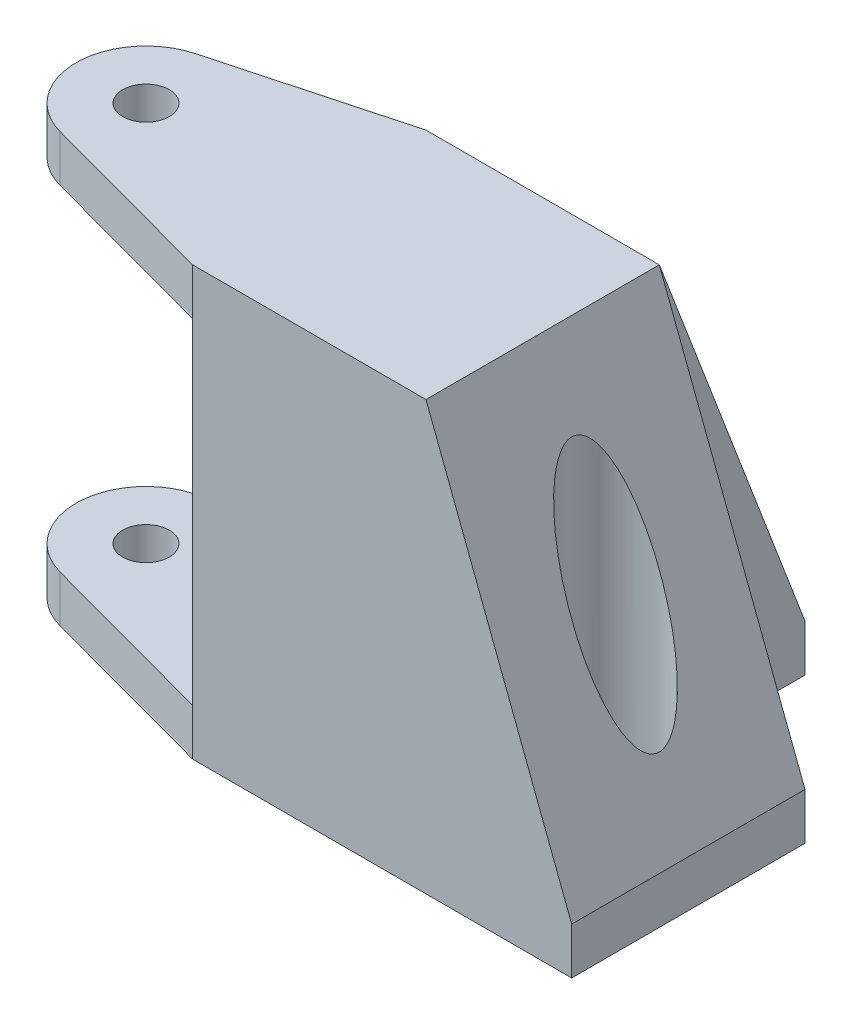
from build123d import *

# Parameters (mm, degrees)
BOSS_EXTRUDE1_DEPTH = 40
BOSS_EXTRUDE2_DEPTH = 73.391828
SKETCH4_W           = 40
SKETCH4_H           = 57.391828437
CUT_EXTRUDE1_DEPTH  = 73
BOSS_EXTRUDE3_DEPTH = 40
SKETCH6_R           = 4
CUT_EXTRUDE2_DEPTH  = 116.699440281
SKETCH8_R           = 7.5
CUT_EXTRUDE3_DEPTH  = 113.594148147


with BuildPart() as part:
    # Sketch2 → Boss-Extrude1 (new body)
    with BuildSketch(Plane.XY):
        Polygon((0, 0), (-40, 0), (-40, 73.391828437), (0, 73.391828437), (24.978165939, 8), (24.978165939, 0), align=None)
    extrude(amount=BOSS_EXTRUDE1_DEPTH)

    # Sketch3 → Boss-Extrude2 (add)
    with BuildSketch(Plane(origin=(0, 73.391828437, 0), x_dir=(1, 0, 0), z_dir=(0, 1, 0))):
        with BuildLine():
            Line((-40, -40), (-71.131560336, -31.584184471))
            ThreePointArc((-71.131560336, -31.584184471), (-80, -20), (-71.131560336, -8.415815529))
            Line((-71.131560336, -8.415815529), (-40, 0))
            Line((-40, 0), (-40, -40))
        make_face()
    extrude(amount=-BOSS_EXTRUDE2_DEPTH)

    # Sketch4 → Cut-Extrude1 (cut)
    with BuildSketch(Plane.XY):
        with Locations((-60, 36.695914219)):
            Rectangle(SKETCH4_W, SKETCH4_H)
    extrude(amount=CUT_EXTRUDE1_DEPTH, mode=Mode.SUBTRACT)

    # Sketch5 → Boss-Extrude3 (add)
    with BuildSketch(Plane(origin=(0, 0, 0), x_dir=(0, 0, -1), z_dir=(1, 0, 0))):
        Polygon((0, 0), (24.978165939, 0), (24.978165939, 8), (0, 73.391828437), align=None)
    extrude(amount=-BOSS_EXTRUDE3_DEPTH)

    # Sketch6 → Cut-Extrude2 (cut, through all)
    with BuildSketch(Plane(origin=(0, 73.391828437, 0), x_dir=(1, 0, 0), z_dir=(0, 1, 0))):
        with Locations(Location((-68, -20, 0), (0, 0, 270))):
            Circle(SKETCH6_R)
        with Locations(Location((-20, 12.489082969, 0), (0, 0, 270))):
            Circle(SKETCH6_R)
        with Locations(Location((12.489082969, -20, 0), (0, 0, 270))):
            Circle(SKETCH6_R)
    extrude(amount=-CUT_EXTRUDE2_DEPTH, mode=Mode.SUBTRACT)

    # Sketch8 → Cut-Extrude3 (cut, through all)
    with BuildSketch(Plane(origin=(0, 5, 0), x_dir=(1, 0, 0), z_dir=(0, 1, 0))):
        with Locations(Location((-20, 12.489082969, 0), (0, 0, 90))):
            Circle(SKETCH8_R)
        with Locations((12.489082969, -20)):
            Circle(SKETCH8_R)
    extrude(amount=CUT_EXTRUDE3_DEPTH, mode=Mode.SUBTRACT)


solid = part.part
